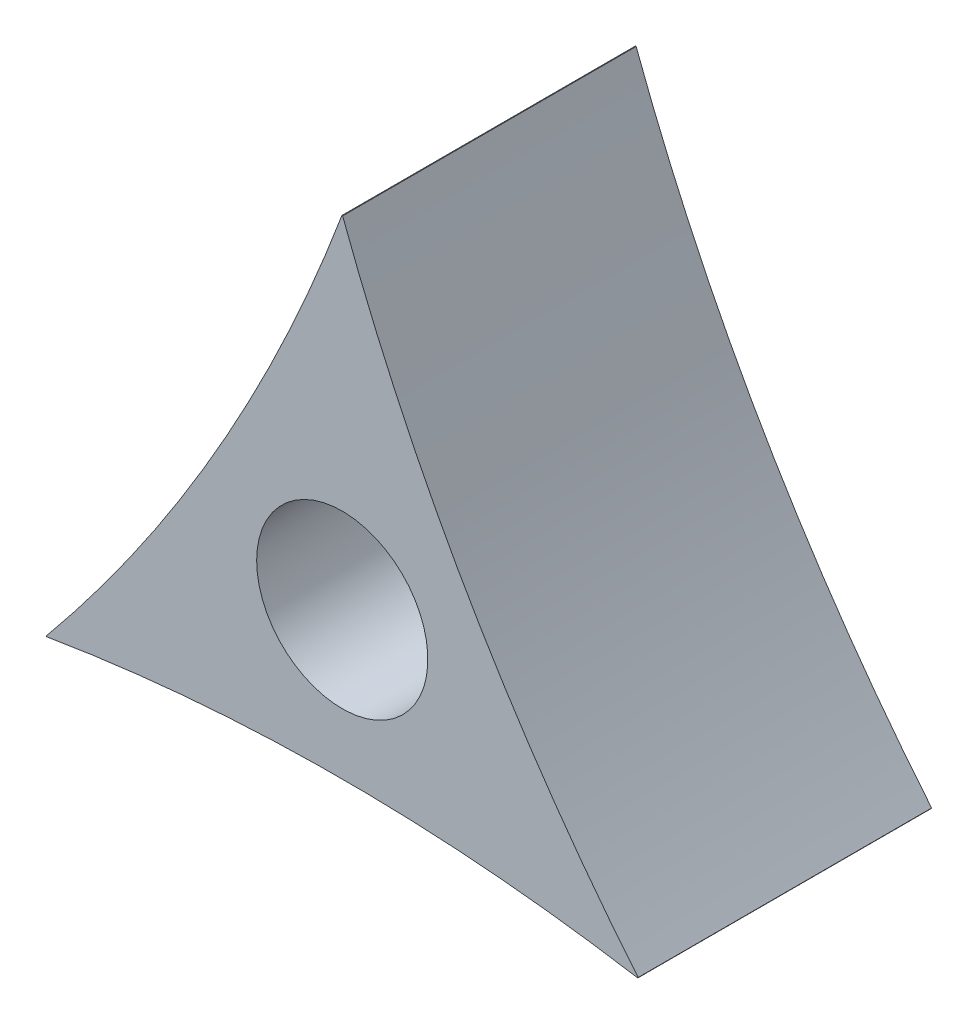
from build123d import *

# Parameters (mm, degrees)
SKETCH1_R           = 44.45
BOSS_EXTRUDE1_DEPTH = 152.4
SKETCH2_W           = 1.524
SKETCH2_H           = 0.508
CUT_EXTRUDE1_DEPTH  = 281.264571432


with BuildPart() as part:
    # Sketch1 → Boss-Extrude1 (new body)
    with BuildSketch(Plane.XY):
        with BuildLine():
            ThreePointArc((153.979316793, -88.9), (0, -76.059268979), (-153.979316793, -88.9))
            ThreePointArc((-153.979316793, -88.9), (-65.869259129, 38.029634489), (0, 177.8))
            ThreePointArc((0, 177.8), (65.869259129, 38.029634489), (153.979316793, -88.9))
        make_face()
        with Locations(Location((0, 0, 0), (0, 0, 180))):
            Circle(SKETCH1_R, mode=Mode.SUBTRACT)
    extrude(amount=BOSS_EXTRUDE1_DEPTH)

    # Sketch2 → Cut-Extrude1 (cut, through all)
    with BuildSketch(Plane.XY.offset(152.4)):
        Polygon((154.360316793, -88.240088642), (153.598316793, -89.559911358), (153.158375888, -89.305911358), (153.920375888, -87.986088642), align=None)
        Polygon((-153.920375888, -87.986088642), (-154.360316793, -88.240088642), (-153.598316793, -89.559911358), (-153.158375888, -89.305911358), align=None)
        with Locations((0, 177.546)):
            Rectangle(SKETCH2_W, SKETCH2_H)
    extrude(amount=-CUT_EXTRUDE1_DEPTH, mode=Mode.SUBTRACT)


solid = part.part
